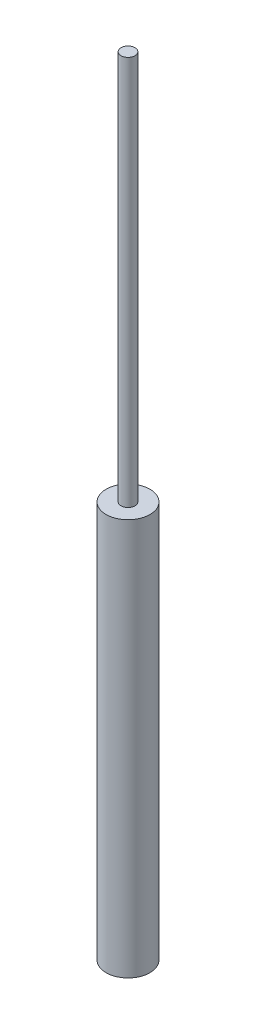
from build123d import *

# Parameters (mm, degrees)
SKETCH1_R           = 20.000000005
BOSS_EXTRUDE1_DEPTH = 603.25
SKETCH2_R           = 16.031467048
CUT_EXTRUDE1_DEPTH  = 604.912710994
SKETCH3_R           = 20.000000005
BOSS_EXTRUDE2_DEPTH = 12.7
SKETCH4_R           = 6.35
BOSS_EXTRUDE3_DEPTH = 101.6
SKETCH6_R           = 33.959624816
CUT_EXTRUDE2_DEPTH  = 254
SKETCH7_R           = 6.35
BOSS_EXTRUDE4_DEPTH = 254


with BuildPart() as part:
    # Sketch1 → Boss-Extrude1 (new body)
    with BuildSketch(Plane(origin=(0, 0, 0), x_dir=(1, 0, 0), z_dir=(0, 1, 0))):
        with Locations(Location((0, 0, 0), (0, 0, 270))):
            Circle(SKETCH1_R)
    extrude(amount=BOSS_EXTRUDE1_DEPTH)

    # Sketch2 → Cut-Extrude1 (cut, through all)
    with BuildSketch(Plane(origin=(0, 603.25, 0), x_dir=(1, 0, 0), z_dir=(0, 1, 0))):
        with Locations(Location((1.24968, 0, 0), (0, 0, 270))):
            Circle(SKETCH2_R)
    extrude(amount=-CUT_EXTRUDE1_DEPTH, mode=Mode.SUBTRACT)

    # Sketch3 → Boss-Extrude2 (add)
    with BuildSketch(Plane(origin=(0, 603.25, 0), x_dir=(1, 0, 0), z_dir=(0, 1, 0))):
        with Locations(Location((0, 0, 0), (0, 0, 270))):
            Circle(SKETCH3_R)
    extrude(amount=BOSS_EXTRUDE2_DEPTH)

    # Sketch4 → Boss-Extrude3 (add)
    with BuildSketch(Plane(origin=(0, 615.95, 0), x_dir=(1, 0, 0), z_dir=(0, 1, 0))):
        with Locations(Location((0, 0, 0), (0, 0, 270))):
            Circle(SKETCH4_R)
    extrude(amount=BOSS_EXTRUDE3_DEPTH)

    # Sketch6 → Cut-Extrude2 (cut)
    with BuildSketch(Plane.XZ):
        Circle(SKETCH6_R)
    extrude(amount=-CUT_EXTRUDE2_DEPTH, mode=Mode.SUBTRACT)

    # Sketch7 → Boss-Extrude4 (add)
    with BuildSketch(Plane(origin=(0, 717.55, 0), x_dir=(1, 0, 0), z_dir=(0, 1, 0))):
        with Locations(Location((0, 0, 0), (0, 0, 270))):
            Circle(SKETCH7_R)
    extrude(amount=BOSS_EXTRUDE4_DEPTH)


solid = part.part
